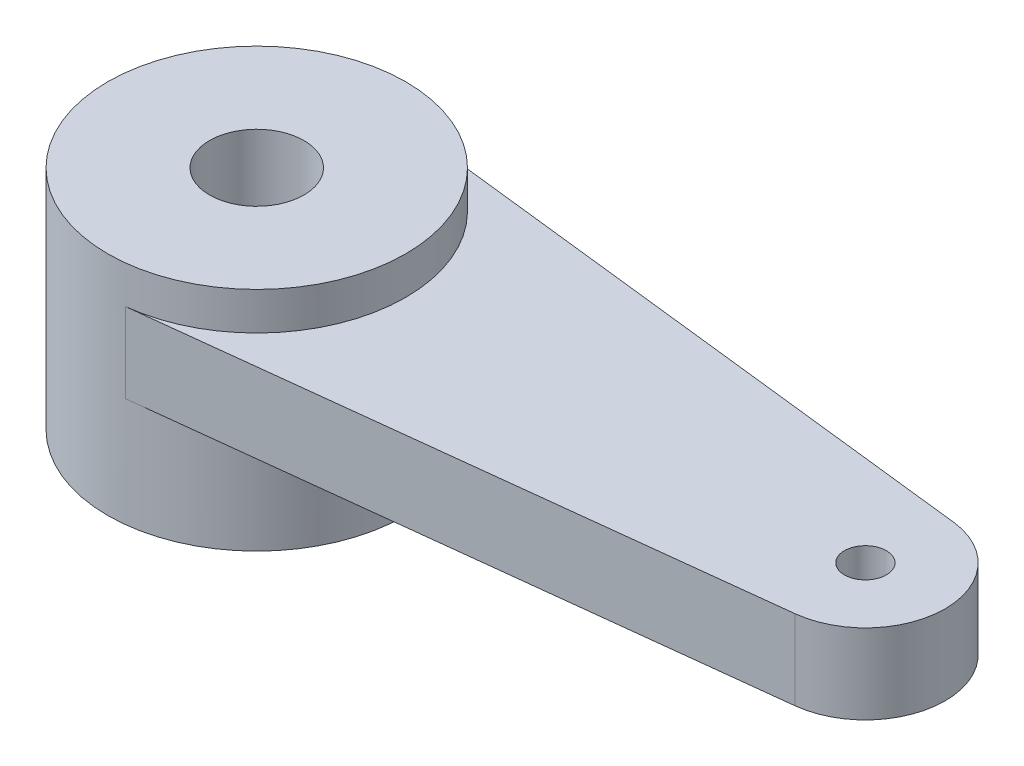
ISO-10303-21;
HEADER;
FILE_DESCRIPTION(('STEP AP214'),'2;1');
FILE_NAME('part.step','',(''),(''),'','','');
FILE_SCHEMA(('AUTOMOTIVE_DESIGN { 1 0 10303 214 1 1 1 1 }'));
ENDSEC;
DATA;
#1=APPLICATION_CONTEXT('core data for automotive mechanical design processes');
#2=APPLICATION_PROTOCOL_DEFINITION('international standard','automotive_design',2000,#1);
#3=PRODUCT_CONTEXT('',#1,'mechanical');
#4=PRODUCT('Part','Part','',(#3));
#5=PRODUCT_RELATED_PRODUCT_CATEGORY('part','',(#4));
#6=PRODUCT_DEFINITION_FORMATION('','',#4);
#7=PRODUCT_DEFINITION_CONTEXT('part definition',#1,'design');
#8=PRODUCT_DEFINITION('design','',#6,#7);
#9=PRODUCT_DEFINITION_SHAPE('','',#8);
#10=(LENGTH_UNIT() NAMED_UNIT(*) SI_UNIT(.MILLI.,.METRE.));
#11=(NAMED_UNIT(*) PLANE_ANGLE_UNIT() SI_UNIT($,.RADIAN.));
#12=(NAMED_UNIT(*) SI_UNIT($,.STERADIAN.) SOLID_ANGLE_UNIT());
#13=UNCERTAINTY_MEASURE_WITH_UNIT(LENGTH_MEASURE(1.E-05),#10,'distance_accuracy_value','');
#14=(GEOMETRIC_REPRESENTATION_CONTEXT(3) GLOBAL_UNCERTAINTY_ASSIGNED_CONTEXT((#13)) GLOBAL_UNIT_ASSIGNED_CONTEXT((#10,
#11,#12)) REPRESENTATION_CONTEXT('',''));
#15=CARTESIAN_POINT('',(0.,0.,0.));
#16=DIRECTION('',(0.,0.,1.));
#17=DIRECTION('',(1.,0.,0.));
#18=AXIS2_PLACEMENT_3D('',#15,#16,#17);
#19=CARTESIAN_POINT('',(0.,0.,0.));
#20=DIRECTION('',(0.,1.,0.));
#21=DIRECTION('',(0.,0.,1.));
#22=AXIS2_PLACEMENT_3D('',#19,#20,#21);
#23=PLANE('',#22);
#24=CARTESIAN_POINT('',(14.5,0.,0.));
#25=DIRECTION('',(0.,1.,0.));
#26=DIRECTION('',(0.,0.,1.));
#27=AXIS2_PLACEMENT_3D('',#24,#25,#26);
#28=CIRCLE('',#27,0.500000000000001);
#29=CARTESIAN_POINT('',(14.5,0.,0.500000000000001));
#30=VERTEX_POINT('',#29);
#31=EDGE_CURVE('E122',#30,#30,#28,.T.);
#32=ORIENTED_EDGE('',*,*,#31,.T.);
#33=EDGE_LOOP('',(#32));
#34=FACE_BOUND('',#33,.T.);
#35=CARTESIAN_POINT('',(0.,0.,0.));
#36=DIRECTION('',(0.,-1.,0.));
#37=DIRECTION('',(0.,0.,-1.));
#38=AXIS2_PLACEMENT_3D('',#35,#36,#37);
#39=CIRCLE('',#38,3.55);
#40=CARTESIAN_POINT('',(0.40396551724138,0.,-3.52694086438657));
#41=VERTEX_POINT('',#40);
#42=CARTESIAN_POINT('',(0.403965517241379,0.,3.52694086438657));
#43=VERTEX_POINT('',#42);
#44=EDGE_CURVE('E88',#41,#43,#39,.T.);
#45=ORIENTED_EDGE('',*,*,#44,.F.);
#46=DIRECTION('',(-0.993504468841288,0.,-0.113793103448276));
#47=VECTOR('',#46,1.);
#48=CARTESIAN_POINT('',(0.403965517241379,0.,-3.52694086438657));
#49=LINE('',#48,#47);
#50=CARTESIAN_POINT('',(14.7162068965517,0.,-1.88765849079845));
#51=VERTEX_POINT('',#50);
#52=EDGE_CURVE('E90',#51,#41,#49,.T.);
#53=ORIENTED_EDGE('',*,*,#52,.F.);
#54=CARTESIAN_POINT('',(14.5,0.,0.));
#55=DIRECTION('',(0.,1.,0.));
#56=DIRECTION('',(0.,0.,1.));
#57=AXIS2_PLACEMENT_3D('',#54,#55,#56);
#58=CIRCLE('',#57,1.9);
#59=CARTESIAN_POINT('',(14.7162068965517,0.,1.88765849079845));
#60=VERTEX_POINT('',#59);
#61=EDGE_CURVE('E76',#60,#51,#58,.T.);
#62=ORIENTED_EDGE('',*,*,#61,.F.);
#63=DIRECTION('',(0.993504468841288,0.,-0.113793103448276));
#64=VECTOR('',#63,1.);
#65=CARTESIAN_POINT('',(14.7162068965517,0.,1.88765849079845));
#66=LINE('',#65,#64);
#67=EDGE_CURVE('E70',#43,#60,#66,.T.);
#68=ORIENTED_EDGE('',*,*,#67,.F.);
#69=EDGE_LOOP('',(#45,#53,#62,#68));
#70=FACE_BOUND('',#69,.T.);
#71=ADVANCED_FACE('F37',(#34,#70),#23,.F.);
#72=CARTESIAN_POINT('',(0.,1.9,0.));
#73=DIRECTION('',(0.,1.,0.));
#74=DIRECTION('',(0.,0.,1.));
#75=AXIS2_PLACEMENT_3D('',#72,#73,#74);
#76=PLANE('',#75);
#77=CARTESIAN_POINT('',(0.,1.9,0.));
#78=DIRECTION('',(0.,1.,0.));
#79=DIRECTION('',(0.,0.,1.));
#80=AXIS2_PLACEMENT_3D('',#77,#78,#79);
#81=CIRCLE('',#80,3.55);
#82=CARTESIAN_POINT('',(0.403965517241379,1.9,3.52694086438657));
#83=VERTEX_POINT('',#82);
#84=CARTESIAN_POINT('',(0.403965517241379,1.9,-3.52694086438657));
#85=VERTEX_POINT('',#84);
#86=EDGE_CURVE('E103',#83,#85,#81,.T.);
#87=ORIENTED_EDGE('',*,*,#86,.F.);
#88=DIRECTION('',(0.993504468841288,0.,-0.113793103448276));
#89=VECTOR('',#88,1.);
#90=CARTESIAN_POINT('',(14.7162068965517,1.9,1.88765849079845));
#91=LINE('',#90,#89);
#92=CARTESIAN_POINT('',(14.7162068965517,1.9,1.88765849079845));
#93=VERTEX_POINT('',#92);
#94=EDGE_CURVE('E80',#83,#93,#91,.T.);
#95=ORIENTED_EDGE('',*,*,#94,.T.);
#96=CARTESIAN_POINT('',(14.5,1.9,0.));
#97=DIRECTION('',(0.,1.,0.));
#98=DIRECTION('',(0.,0.,1.));
#99=AXIS2_PLACEMENT_3D('',#96,#97,#98);
#100=CIRCLE('',#99,1.9);
#101=CARTESIAN_POINT('',(14.7162068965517,1.9,-1.88765849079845));
#102=VERTEX_POINT('',#101);
#103=EDGE_CURVE('E106',#93,#102,#100,.T.);
#104=ORIENTED_EDGE('',*,*,#103,.T.);
#105=DIRECTION('',(-0.993504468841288,0.,-0.113793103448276));
#106=VECTOR('',#105,1.);
#107=CARTESIAN_POINT('',(0.403965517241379,1.9,-3.52694086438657));
#108=LINE('',#107,#106);
#109=EDGE_CURVE('E56',#102,#85,#108,.T.);
#110=ORIENTED_EDGE('',*,*,#109,.T.);
#111=EDGE_LOOP('',(#87,#95,#104,#110));
#112=FACE_BOUND('',#111,.T.);
#113=CARTESIAN_POINT('',(14.5,1.9,0.));
#114=DIRECTION('',(0.,1.,0.));
#115=DIRECTION('',(0.,0.,1.));
#116=AXIS2_PLACEMENT_3D('',#113,#114,#115);
#117=CIRCLE('',#116,0.500000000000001);
#118=CARTESIAN_POINT('',(14.5,1.9,0.500000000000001));
#119=VERTEX_POINT('',#118);
#120=EDGE_CURVE('E125',#119,#119,#117,.T.);
#121=ORIENTED_EDGE('',*,*,#120,.F.);
#122=EDGE_LOOP('',(#121));
#123=FACE_BOUND('',#122,.T.);
#124=ADVANCED_FACE('F159',(#112,#123),#76,.T.);
#125=CARTESIAN_POINT('',(0.,1.9,0.));
#126=DIRECTION('',(0.,-1.,0.));
#127=DIRECTION('',(0.,0.,-1.));
#128=AXIS2_PLACEMENT_3D('',#125,#126,#127);
#129=CYLINDRICAL_SURFACE('',#128,3.55);
#130=DIRECTION('',(0.,-1.,0.));
#131=VECTOR('',#130,1.);
#132=CARTESIAN_POINT('',(0.403965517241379,1.9,-3.52694086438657));
#133=LINE('',#132,#131);
#134=EDGE_CURVE('E98',#85,#41,#133,.T.);
#135=ORIENTED_EDGE('',*,*,#134,.T.);
#136=ORIENTED_EDGE('',*,*,#44,.T.);
#137=DIRECTION('',(0.,-1.,0.));
#138=VECTOR('',#137,1.);
#139=CARTESIAN_POINT('',(0.403965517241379,1.9,3.52694086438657));
#140=LINE('',#139,#138);
#141=EDGE_CURVE('E12',#83,#43,#140,.T.);
#142=ORIENTED_EDGE('',*,*,#141,.F.);
#143=ORIENTED_EDGE('',*,*,#86,.T.);
#144=EDGE_LOOP('',(#135,#136,#142,#143));
#145=FACE_BOUND('',#144,.T.);
#146=CARTESIAN_POINT('',(0.,2.8,0.));
#147=DIRECTION('',(0.,1.,0.));
#148=DIRECTION('',(0.,0.,1.));
#149=AXIS2_PLACEMENT_3D('',#146,#147,#148);
#150=CIRCLE('',#149,3.55);
#151=CARTESIAN_POINT('',(0.,2.8,3.55));
#152=VERTEX_POINT('',#151);
#153=EDGE_CURVE('E119',#152,#152,#150,.T.);
#154=ORIENTED_EDGE('',*,*,#153,.F.);
#155=EDGE_LOOP('',(#154));
#156=FACE_BOUND('',#155,.T.);
#157=CARTESIAN_POINT('',(0.,-2.6,0.));
#158=DIRECTION('',(0.,1.,0.));
#159=DIRECTION('',(0.,0.,1.));
#160=AXIS2_PLACEMENT_3D('',#157,#158,#159);
#161=CIRCLE('',#160,3.55);
#162=CARTESIAN_POINT('',(0.,-2.6,3.55));
#163=VERTEX_POINT('',#162);
#164=EDGE_CURVE('E93',#163,#163,#161,.T.);
#165=ORIENTED_EDGE('',*,*,#164,.T.);
#166=EDGE_LOOP('',(#165));
#167=FACE_BOUND('',#166,.T.);
#168=ADVANCED_FACE('F39',(#145,#156,#167),#129,.T.);
#169=CARTESIAN_POINT('',(14.7162068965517,1.9,1.88765849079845));
#170=DIRECTION('',(-0.113793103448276,0.,-0.993504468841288));
#171=DIRECTION('',(-0.993504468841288,0.,0.113793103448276));
#172=AXIS2_PLACEMENT_3D('',#169,#170,#171);
#173=PLANE('',#172);
#174=ORIENTED_EDGE('',*,*,#67,.T.);
#175=DIRECTION('',(0.,-1.,0.));
#176=VECTOR('',#175,1.);
#177=CARTESIAN_POINT('',(14.7162068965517,1.9,1.88765849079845));
#178=LINE('',#177,#176);
#179=EDGE_CURVE('E47',#93,#60,#178,.T.);
#180=ORIENTED_EDGE('',*,*,#179,.F.);
#181=ORIENTED_EDGE('',*,*,#94,.F.);
#182=ORIENTED_EDGE('',*,*,#141,.T.);
#183=EDGE_LOOP('',(#174,#180,#181,#182));
#184=FACE_BOUND('',#183,.T.);
#185=ADVANCED_FACE('F166',(#184),#173,.F.);
#186=CARTESIAN_POINT('',(14.5,1.9,0.));
#187=DIRECTION('',(0.,-1.,0.));
#188=DIRECTION('',(0.,0.,-1.));
#189=AXIS2_PLACEMENT_3D('',#186,#187,#188);
#190=CYLINDRICAL_SURFACE('',#189,1.9);
#191=ORIENTED_EDGE('',*,*,#61,.T.);
#192=DIRECTION('',(0.,-1.,0.));
#193=VECTOR('',#192,1.);
#194=CARTESIAN_POINT('',(14.7162068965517,1.9,-1.88765849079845));
#195=LINE('',#194,#193);
#196=EDGE_CURVE('E100',#102,#51,#195,.T.);
#197=ORIENTED_EDGE('',*,*,#196,.F.);
#198=ORIENTED_EDGE('',*,*,#103,.F.);
#199=ORIENTED_EDGE('',*,*,#179,.T.);
#200=EDGE_LOOP('',(#191,#197,#198,#199));
#201=FACE_BOUND('',#200,.T.);
#202=ADVANCED_FACE('F155',(#201),#190,.T.);
#203=CARTESIAN_POINT('',(0.403965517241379,1.9,-3.52694086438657));
#204=DIRECTION('',(-0.113793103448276,0.,0.993504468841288));
#205=DIRECTION('',(0.993504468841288,0.,0.113793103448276));
#206=AXIS2_PLACEMENT_3D('',#203,#204,#205);
#207=PLANE('',#206);
#208=ORIENTED_EDGE('',*,*,#52,.T.);
#209=ORIENTED_EDGE('',*,*,#134,.F.);
#210=ORIENTED_EDGE('',*,*,#109,.F.);
#211=ORIENTED_EDGE('',*,*,#196,.T.);
#212=EDGE_LOOP('',(#208,#209,#210,#211));
#213=FACE_BOUND('',#212,.T.);
#214=ADVANCED_FACE('F97',(#213),#207,.F.);
#215=CARTESIAN_POINT('',(14.5,1.9,0.));
#216=DIRECTION('',(0.,-1.,0.));
#217=DIRECTION('',(0.,0.,-1.));
#218=AXIS2_PLACEMENT_3D('',#215,#216,#217);
#219=CYLINDRICAL_SURFACE('',#218,0.500000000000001);
#220=ORIENTED_EDGE('',*,*,#120,.T.);
#221=EDGE_LOOP('',(#220));
#222=FACE_BOUND('',#221,.T.);
#223=ORIENTED_EDGE('',*,*,#31,.F.);
#224=EDGE_LOOP('',(#223));
#225=FACE_BOUND('',#224,.T.);
#226=ADVANCED_FACE('F144',(#222,#225),#219,.F.);
#227=CARTESIAN_POINT('',(0.,2.8,0.));
#228=DIRECTION('',(0.,1.,0.));
#229=DIRECTION('',(0.,0.,1.));
#230=AXIS2_PLACEMENT_3D('',#227,#228,#229);
#231=PLANE('',#230);
#232=CARTESIAN_POINT('',(0.,2.8,0.));
#233=DIRECTION('',(0.,1.,0.));
#234=DIRECTION('',(0.,0.,1.));
#235=AXIS2_PLACEMENT_3D('',#232,#233,#234);
#236=CIRCLE('',#235,1.125);
#237=CARTESIAN_POINT('',(0.,2.8,1.125));
#238=VERTEX_POINT('',#237);
#239=EDGE_CURVE('E245',#238,#238,#236,.T.);
#240=ORIENTED_EDGE('',*,*,#239,.F.);
#241=EDGE_LOOP('',(#240));
#242=FACE_BOUND('',#241,.T.);
#243=ORIENTED_EDGE('',*,*,#153,.T.);
#244=EDGE_LOOP('',(#243));
#245=FACE_BOUND('',#244,.T.);
#246=ADVANCED_FACE('F146',(#242,#245),#231,.T.);
#247=CARTESIAN_POINT('',(0.,-2.6,0.));
#248=DIRECTION('',(0.,1.,0.));
#249=DIRECTION('',(0.,0.,1.));
#250=AXIS2_PLACEMENT_3D('',#247,#248,#249);
#251=PLANE('',#250);
#252=CARTESIAN_POINT('',(0.,-2.6,0.));
#253=DIRECTION('',(0.,-1.,0.));
#254=DIRECTION('',(0.,0.,-1.));
#255=AXIS2_PLACEMENT_3D('',#252,#253,#254);
#256=CIRCLE('',#255,2.4);
#257=CARTESIAN_POINT('',(0.,-2.6,-2.4));
#258=VERTEX_POINT('',#257);
#259=EDGE_CURVE('E247',#258,#258,#256,.T.);
#260=ORIENTED_EDGE('',*,*,#259,.F.);
#261=EDGE_LOOP('',(#260));
#262=FACE_BOUND('',#261,.T.);
#263=ORIENTED_EDGE('',*,*,#164,.F.);
#264=EDGE_LOOP('',(#263));
#265=FACE_BOUND('',#264,.T.);
#266=ADVANCED_FACE('F152',(#262,#265),#251,.F.);
#267=CARTESIAN_POINT('',(0.,0.6,0.));
#268=DIRECTION('',(0.,-1.,0.));
#269=DIRECTION('',(0.,0.,-1.));
#270=AXIS2_PLACEMENT_3D('',#267,#268,#269);
#271=CYLINDRICAL_SURFACE('',#270,2.4);
#272=CARTESIAN_POINT('',(0.,0.6,0.));
#273=DIRECTION('',(0.,-1.,0.));
#274=DIRECTION('',(0.,0.,-1.));
#275=AXIS2_PLACEMENT_3D('',#272,#273,#274);
#276=CIRCLE('',#275,2.4);
#277=CARTESIAN_POINT('',(0.,0.6,-2.4));
#278=VERTEX_POINT('',#277);
#279=EDGE_CURVE('E94',#278,#278,#276,.T.);
#280=ORIENTED_EDGE('',*,*,#279,.F.);
#281=EDGE_LOOP('',(#280));
#282=FACE_BOUND('',#281,.T.);
#283=ORIENTED_EDGE('',*,*,#259,.T.);
#284=EDGE_LOOP('',(#283));
#285=FACE_BOUND('',#284,.T.);
#286=ADVANCED_FACE('F204',(#282,#285),#271,.F.);
#287=CARTESIAN_POINT('',(0.,0.6,0.));
#288=DIRECTION('',(0.,-1.,0.));
#289=DIRECTION('',(0.,0.,-1.));
#290=AXIS2_PLACEMENT_3D('',#287,#288,#289);
#291=PLANE('',#290);
#292=CARTESIAN_POINT('',(0.,0.6,0.));
#293=DIRECTION('',(0.,-1.,0.));
#294=DIRECTION('',(0.,0.,-1.));
#295=AXIS2_PLACEMENT_3D('',#292,#293,#294);
#296=CIRCLE('',#295,1.125);
#297=CARTESIAN_POINT('',(0.,0.6,1.125));
#298=VERTEX_POINT('',#297);
#299=EDGE_CURVE('E41',#298,#298,#296,.T.);
#300=ORIENTED_EDGE('',*,*,#299,.F.);
#301=EDGE_LOOP('',(#300));
#302=FACE_BOUND('',#301,.T.);
#303=ORIENTED_EDGE('',*,*,#279,.T.);
#304=EDGE_LOOP('',(#303));
#305=FACE_BOUND('',#304,.T.);
#306=ADVANCED_FACE('F214',(#302,#305),#291,.T.);
#307=CARTESIAN_POINT('',(0.,-2.6,0.));
#308=DIRECTION('',(0.,1.,0.));
#309=DIRECTION('',(0.,0.,1.));
#310=AXIS2_PLACEMENT_3D('',#307,#308,#309);
#311=CYLINDRICAL_SURFACE('',#310,1.125);
#312=CARTESIAN_POINT('',(0.,0.6,1.125));
#313=CARTESIAN_POINT('',(0.,0.622916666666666,1.125));
#314=CARTESIAN_POINT('',(0.,0.645833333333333,1.125));
#315=CARTESIAN_POINT('',(0.,0.691666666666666,1.125));
#316=CARTESIAN_POINT('',(0.,0.714583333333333,1.125));
#317=CARTESIAN_POINT('',(0.,0.760416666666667,1.125));
#318=CARTESIAN_POINT('',(0.,0.783333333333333,1.125));
#319=CARTESIAN_POINT('',(0.,0.829166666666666,1.125));
#320=CARTESIAN_POINT('',(0.,0.852083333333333,1.125));
#321=CARTESIAN_POINT('',(0.,0.897916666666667,1.125));
#322=CARTESIAN_POINT('',(0.,0.920833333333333,1.125));
#323=CARTESIAN_POINT('',(0.,0.966666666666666,1.125));
#324=CARTESIAN_POINT('',(0.,0.989583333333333,1.125));
#325=CARTESIAN_POINT('',(0.,1.03541666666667,1.125));
#326=CARTESIAN_POINT('',(0.,1.05833333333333,1.125));
#327=CARTESIAN_POINT('',(0.,1.10416666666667,1.125));
#328=CARTESIAN_POINT('',(0.,1.12708333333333,1.125));
#329=CARTESIAN_POINT('',(0.,1.17291666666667,1.125));
#330=CARTESIAN_POINT('',(0.,1.19583333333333,1.125));
#331=CARTESIAN_POINT('',(0.,1.24166666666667,1.125));
#332=CARTESIAN_POINT('',(0.,1.26458333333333,1.125));
#333=CARTESIAN_POINT('',(0.,1.31041666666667,1.125));
#334=CARTESIAN_POINT('',(0.,1.33333333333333,1.125));
#335=CARTESIAN_POINT('',(0.,1.37916666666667,1.125));
#336=CARTESIAN_POINT('',(0.,1.40208333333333,1.125));
#337=CARTESIAN_POINT('',(0.,1.44791666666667,1.125));
#338=CARTESIAN_POINT('',(0.,1.47083333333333,1.125));
#339=CARTESIAN_POINT('',(0.,1.51666666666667,1.125));
#340=CARTESIAN_POINT('',(0.,1.53958333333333,1.125));
#341=CARTESIAN_POINT('',(0.,1.58541666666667,1.125));
#342=CARTESIAN_POINT('',(0.,1.60833333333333,1.125));
#343=CARTESIAN_POINT('',(0.,1.65416666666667,1.125));
#344=CARTESIAN_POINT('',(0.,1.67708333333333,1.125));
#345=CARTESIAN_POINT('',(0.,1.72291666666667,1.125));
#346=CARTESIAN_POINT('',(0.,1.74583333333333,1.125));
#347=CARTESIAN_POINT('',(0.,1.79166666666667,1.125));
#348=CARTESIAN_POINT('',(0.,1.81458333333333,1.125));
#349=CARTESIAN_POINT('',(0.,1.86041666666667,1.125));
#350=CARTESIAN_POINT('',(0.,1.88333333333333,1.125));
#351=CARTESIAN_POINT('',(0.,1.92916666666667,1.125));
#352=CARTESIAN_POINT('',(0.,1.95208333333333,1.125));
#353=CARTESIAN_POINT('',(0.,1.99791666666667,1.125));
#354=CARTESIAN_POINT('',(0.,2.02083333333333,1.125));
#355=CARTESIAN_POINT('',(0.,2.06666666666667,1.125));
#356=CARTESIAN_POINT('',(0.,2.08958333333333,1.125));
#357=CARTESIAN_POINT('',(0.,2.13541666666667,1.125));
#358=CARTESIAN_POINT('',(0.,2.15833333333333,1.125));
#359=CARTESIAN_POINT('',(0.,2.20416666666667,1.125));
#360=CARTESIAN_POINT('',(0.,2.22708333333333,1.125));
#361=CARTESIAN_POINT('',(0.,2.27291666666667,1.125));
#362=CARTESIAN_POINT('',(0.,2.29583333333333,1.125));
#363=CARTESIAN_POINT('',(0.,2.34166666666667,1.125));
#364=CARTESIAN_POINT('',(0.,2.36458333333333,1.125));
#365=CARTESIAN_POINT('',(0.,2.41041666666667,1.125));
#366=CARTESIAN_POINT('',(0.,2.43333333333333,1.125));
#367=CARTESIAN_POINT('',(0.,2.47916666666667,1.125));
#368=CARTESIAN_POINT('',(0.,2.50208333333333,1.125));
#369=CARTESIAN_POINT('',(0.,2.54791666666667,1.125));
#370=CARTESIAN_POINT('',(0.,2.57083333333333,1.125));
#371=CARTESIAN_POINT('',(0.,2.61666666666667,1.125));
#372=CARTESIAN_POINT('',(0.,2.63958333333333,1.125));
#373=CARTESIAN_POINT('',(0.,2.68541666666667,1.125));
#374=CARTESIAN_POINT('',(0.,2.70833333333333,1.125));
#375=CARTESIAN_POINT('',(0.,2.75416666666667,1.125));
#376=CARTESIAN_POINT('',(0.,2.77708333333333,1.125));
#377=CARTESIAN_POINT('',(0.,2.8,1.125));
#378=B_SPLINE_CURVE_WITH_KNOTS('',3,(#312,#313,#314,#315,#316,#317,#318,#319,#320,#321,#322,
#323,#324,#325,#326,#327,#328,#329,#330,#331,#332,#333,#334,#335,#336,#337,#338,#339,#340,#341,
#342,#343,#344,#345,#346,#347,#348,#349,#350,#351,#352,#353,#354,#355,#356,#357,#358,#359,#360,
#361,#362,#363,#364,#365,#366,#367,#368,#369,#370,#371,#372,#373,#374,#375,#376,#377),
.UNSPECIFIED.,.F.,.F.,(4,2,2,2,2,2,2,2,2,2,2,2,2,2,2,2,2,2,2,2,2,2,2,2,2,2,2,2,2,2,2,2,4),(0.,
0.0687499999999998,0.1375,0.20625,0.275,0.34375,0.4125,0.48125,0.55,0.61875,0.6875,0.75625,
0.825,0.893749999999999,0.962499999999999,1.03125,1.1,1.16875,1.2375,1.30625,1.375,1.44375,
1.5125,1.58125,1.65,1.71875,1.7875,1.85625,1.925,1.99375,2.0625,2.13125,2.2),.UNSPECIFIED.);
#379=EDGE_CURVE('BSEAM223',#298,#238,#378,.T.);
#380=ORIENTED_EDGE('',*,*,#299,.T.);
#381=ORIENTED_EDGE('',*,*,#239,.T.);
#382=ORIENTED_EDGE('',*,*,#379,.T.);
#383=ORIENTED_EDGE('',*,*,#379,.F.);
#384=EDGE_LOOP('',(#380,#382,#381,#383));
#385=FACE_BOUND('',#384,.T.);
#386=ADVANCED_FACE('F223',(#385),#311,.F.);
#387=CLOSED_SHELL('',(#71,#124,#168,#185,#202,#214,#226,#246,#266,#286,#306,#386));
#388=MANIFOLD_SOLID_BREP('B2',#387);
#389=ADVANCED_BREP_SHAPE_REPRESENTATION('',(#18,#388),#14);
#390=SHAPE_DEFINITION_REPRESENTATION(#9,#389);
ENDSEC;
END-ISO-10303-21;
